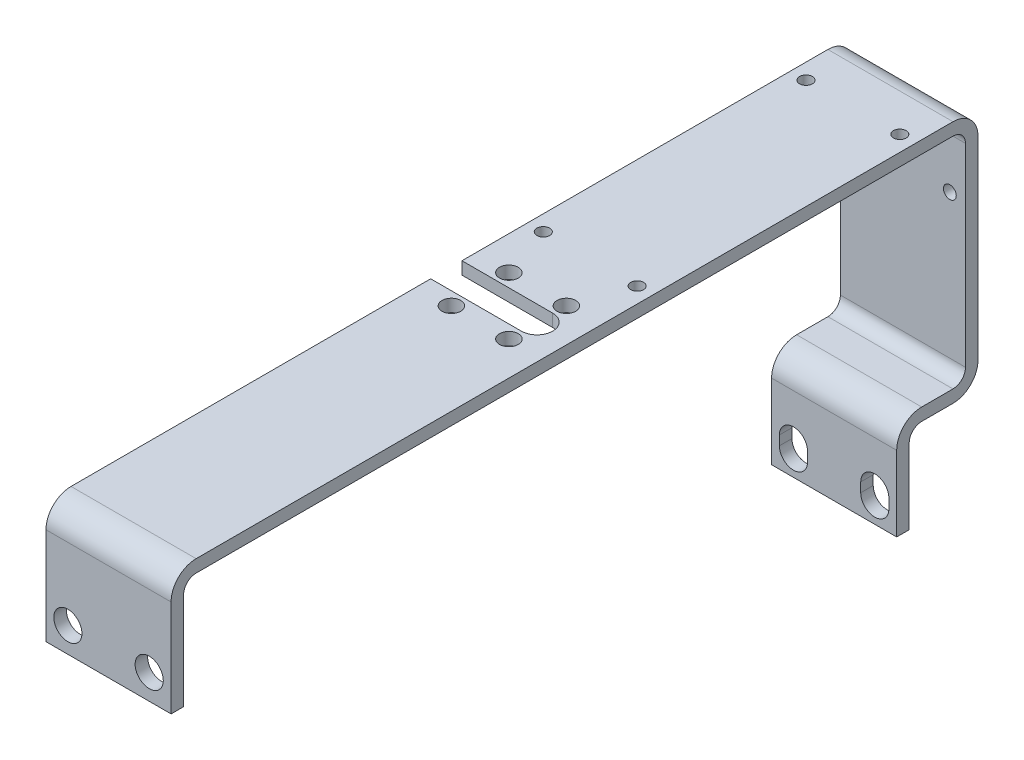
from build123d import *

# Parameters (mm, degrees)
EXTRUDE_1_DEPTH          = 20
SKETCH_4_R               = 2.25
CUT_EXTRUDE_2_DEPTH      = 84.246621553
SKETCH_5_R               = 2.5
CUT_EXTRUDE_3_DEPTH      = 82.792420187
HOLE_WIZARD_M2_51_D      = 2.05
HOLE_WIZARD_M2_51_DEPTH  = 2
HOLE_WIZARD_M2_52_D      = 2.05
EXTRUDE_2_DEPTH          = 20
SKETCH_15_W              = 8.5
SKETCH_15_H              = 4
CUT_EXTRUDE_5_DEPTH      = 130.09298974
CUT_EXTRUDE_7_REACH      = 142.89
SKETCH_17_R              = 2.25
CUT_EXTRUDE_9_DEPTH      = 130.09298974
HOLE_WIZARD_3_0_3_1_D    = 3
PATTERN_CIRCULAR_1_COUNT = 4
CUT_EXTRUDE_10_DEPTH     = 130.09298974
SKETCH_22_W              = 5.5
SKETCH_22_H              = 5
CUT_EXTRUDE_11_DEPTH     = 130.09298974


with BuildPart() as part:
    # Sketch 1 → Extrude 1 (new body)
    with BuildSketch(Plane(origin=(0, 0, 0), x_dir=(0, 0, -1), z_dir=(1, 0, 0))):
        with BuildLine():
            Line((0, 0), (0, 12))
            ThreePointArc((0, 12), (1.171572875, 14.828427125), (4, 16))
            Line((4, 16), (9, 16))
            ThreePointArc((9, 16), (10.414213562, 16.585786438), (11, 18))
            Line((11, 18), (11, 49))
            ThreePointArc((11, 49), (10.414213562, 50.414213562), (9, 51))
            Line((9, 51), (-59, 51))
            Line((-59, 51), (-59, 53))
            Line((-59, 53), (9, 53))
            ThreePointArc((9, 53), (11.828427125, 51.828427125), (13, 49))
            Line((13, 49), (13, 18))
            ThreePointArc((13, 18), (11.828427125, 15.171572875), (9, 14))
            Line((9, 14), (4, 14))
            ThreePointArc((4, 14), (2.585786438, 13.414213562), (2, 12))
            Line((2, 12), (2, 0))
            Line((2, 0), (0, 0))
        make_face()
    extrude(amount=EXTRUDE_1_DEPTH)

    # Sketch 4 → Cut-Extrude 2 (cut, through all)
    with BuildSketch(Plane(origin=(0, 0, -2), x_dir=(-1, 0, 0), z_dir=(0, 0, -1))):
        with Locations(Location((-16.5, 4, 0), (0, 0, 90))):
            Circle(SKETCH_4_R)
        with Locations(Location((-3.5, 4, 0), (0, 0, 90))):
            Circle(SKETCH_4_R)
    extrude(amount=-CUT_EXTRUDE_2_DEPTH, mode=Mode.SUBTRACT)

    # Sketch 5 → Cut-Extrude 3 (cut, through all)
    with BuildSketch(Plane(origin=(0, 53, 0), x_dir=(1, 0, 0), z_dir=(0, 1, 0))):
        with Locations(Location((10, -52, 0), (0, 0, 270))):
            Circle(SKETCH_5_R)
    extrude(amount=-CUT_EXTRUDE_3_DEPTH, mode=Mode.SUBTRACT)

    # Hole Wizard M2.51
    with Locations(Plane(origin=(0, 53, 0), x_dir=(-1, 0, 0), z_dir=(0, 1, 0))):
        with Locations((-17.5, 39), (-2.5, 39), (-17.5, -3), (-2.5, -3)):
            Hole(HOLE_WIZARD_M2_51_D / 2, depth=HOLE_WIZARD_M2_51_DEPTH)

    # Hole Wizard M2.52 (through all)
    with Locations(Plane(origin=(0, 0, -13), x_dir=(-1, 0, 0), z_dir=(0, 0, -1))):
        with Locations((-17.5, 41), (-2.5, 41)):
            Hole(HOLE_WIZARD_M2_52_D / 2)

    # Sketch 14 → Extrude 2 (add)
    with BuildSketch(Plane(origin=(20, 0, 0), x_dir=(0, 0, -1), z_dir=(1, 0, 0))):
        with BuildLine():
            Line((-59, 53), (-112, 53))
            ThreePointArc((-112, 53), (-114.828427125, 51.828427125), (-116, 49))
            Line((-116, 49), (-116, 33.5))
            Line((-116, 33.5), (-114, 33.5))
            Line((-114, 33.5), (-114, 49))
            ThreePointArc((-114, 49), (-113.414213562, 50.414213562), (-112, 51))
            Line((-112, 51), (-59, 51))
            Line((-59, 51), (-59, 53))
        make_face()
    extrude(amount=-EXTRUDE_2_DEPTH)

    # Sketch 15 → Cut-Extrude 5 (cut, through all)
    with BuildSketch(Plane(origin=(0, 53, 0), x_dir=(1, 0, 0), z_dir=(0, 1, 0))):
        with Locations((4.25, -52)):
            Rectangle(SKETCH_15_W, SKETCH_15_H)
    extrude(amount=-CUT_EXTRUDE_5_DEPTH, mode=Mode.SUBTRACT)

    # Sketch 17 → Cut-Extrude 7 (cut, up to next)
    with BuildSketch(Plane.XY.offset(116), mode=Mode.PRIVATE) as cut_extrude_7_sk1:
        with Locations((3.5, 37.5)):
            Circle(SKETCH_17_R)
    cut_extrude_7_tool1 = extrude(cut_extrude_7_sk1.sketch, amount=-CUT_EXTRUDE_7_REACH, mode=Mode.PRIVATE) & part.part
    # Sketch 17 → Cut-Extrude 7 (cut, up to next)
    with BuildSketch(Plane.XY.offset(116), mode=Mode.PRIVATE) as cut_extrude_7_sk2:
        with Locations(Location((16.5, 37.5, 0), (0, 0, 90))):
            Circle(SKETCH_17_R)
    cut_extrude_7_tool2 = extrude(cut_extrude_7_sk2.sketch, amount=-CUT_EXTRUDE_7_REACH, mode=Mode.PRIVATE) & part.part
    add(cut_extrude_7_tool1.solids().sort_by_distance((3.5, 37.5, 116))[0], mode=Mode.SUBTRACT)
    add(cut_extrude_7_tool2.solids().sort_by_distance((16.5, 37.5, 116))[0], mode=Mode.SUBTRACT)

    # Sketch 20 → Cut-Extrude 9 (cut, through all)
    with BuildSketch(Plane(origin=(0, 53, 0), x_dir=(1, 0, 0), z_dir=(0, 1, 0))):
        with BuildLine():
            Line((5.5, -49.5), (14.5, -49.5))
            ThreePointArc((14.5, -49.5), (17, -52), (14.5, -54.5))
            Line((14.5, -54.5), (5.5, -54.5))
            ThreePointArc((5.5, -54.5), (3, -52), (5.5, -49.5))
        make_face()
    extrude(amount=-CUT_EXTRUDE_9_DEPTH, mode=Mode.SUBTRACT)

    # Hole Wizard 3.0 _3_1 (through all)
    with Locations(Plane(origin=(0, 53, 0), x_dir=(-1, 0, 0), z_dir=(0, 1, 0))):
        with Locations((-5.403805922, 47.403805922)):
            hole_wizard_3_0_3_1 = Hole(HOLE_WIZARD_3_0_3_1_D / 2)

    # Pattern Circular 1: Hole Wizard 3.0 _3_1 ×4 about axis
    pattern_circular_1_axis = Axis((10, 0, 52), (0, 1, 0))
    for i in range(1, PATTERN_CIRCULAR_1_COUNT):
        add(hole_wizard_3_0_3_1.rotate(pattern_circular_1_axis, i * 360 / PATTERN_CIRCULAR_1_COUNT), mode=Mode.SUBTRACT)

    # Sketch 21 → Cut-Extrude 10 (cut, through all)
    with BuildSketch(Plane.XY):
        with BuildLine():
            Line((1.25, 3.25), (1.25, 4.75))
            ThreePointArc((1.25, 4.75), (3.5, 7), (5.75, 4.75))
            Line((5.75, 4.75), (5.75, 3.25))
            ThreePointArc((5.75, 3.25), (3.5, 1), (1.25, 3.25))
        make_face()
        with BuildLine():
            Line((18.75, 3.25), (18.75, 4.75))
            ThreePointArc((18.75, 4.75), (16.5, 7), (14.25, 4.75))
            Line((14.25, 4.75), (14.25, 3.25))
            ThreePointArc((14.25, 3.25), (16.5, 1), (18.75, 3.25))
        make_face()
    extrude(amount=-CUT_EXTRUDE_10_DEPTH, mode=Mode.SUBTRACT)

    # Sketch 22 → Cut-Extrude 11 (cut, through all)
    with BuildSketch(Plane(origin=(0, 53, 0), x_dir=(1, 0, 0), z_dir=(0, 1, 0))):
        with Locations((2.75, -52)):
            Rectangle(SKETCH_22_W, SKETCH_22_H)
    extrude(amount=-CUT_EXTRUDE_11_DEPTH, mode=Mode.SUBTRACT)


solid = part.part
